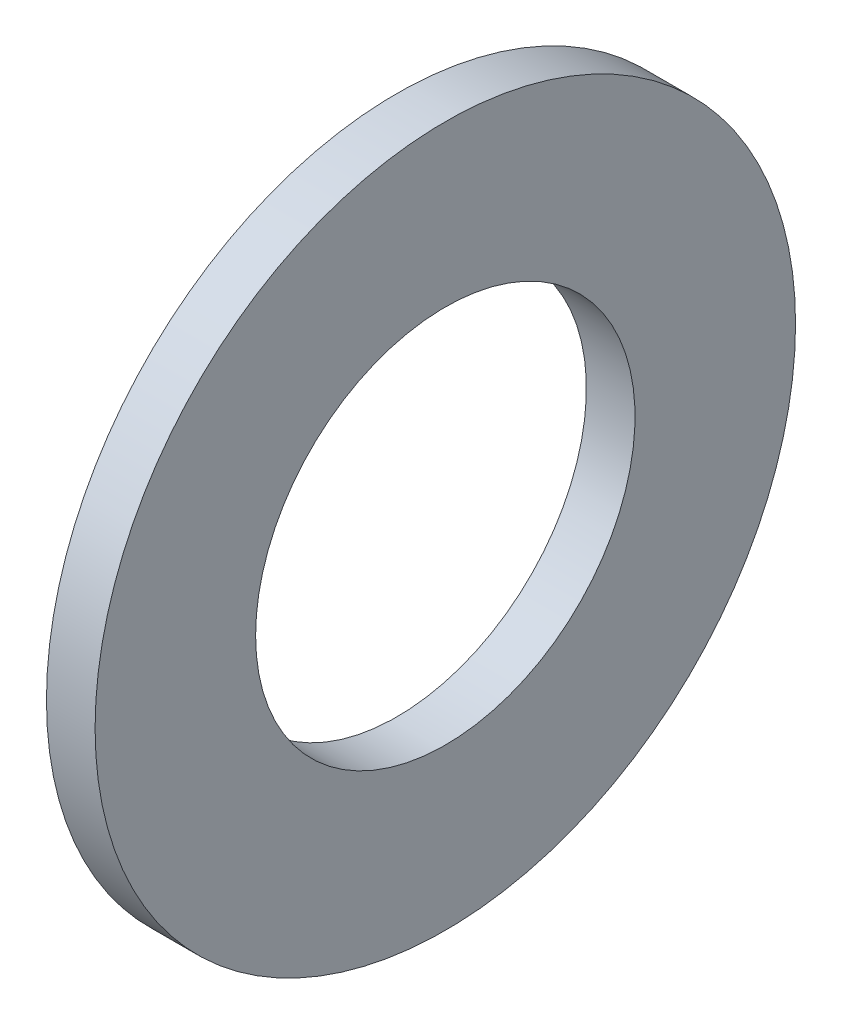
ISO-10303-21;
HEADER;
FILE_DESCRIPTION(('STEP AP214'),'2;1');
FILE_NAME('part.step','',(''),(''),'','','');
FILE_SCHEMA(('AUTOMOTIVE_DESIGN { 1 0 10303 214 1 1 1 1 }'));
ENDSEC;
DATA;
#1=APPLICATION_CONTEXT('core data for automotive mechanical design processes');
#2=APPLICATION_PROTOCOL_DEFINITION('international standard','automotive_design',2000,#1);
#3=PRODUCT_CONTEXT('',#1,'mechanical');
#4=PRODUCT('Part','Part','',(#3));
#5=PRODUCT_RELATED_PRODUCT_CATEGORY('part','',(#4));
#6=PRODUCT_DEFINITION_FORMATION('','',#4);
#7=PRODUCT_DEFINITION_CONTEXT('part definition',#1,'design');
#8=PRODUCT_DEFINITION('design','',#6,#7);
#9=PRODUCT_DEFINITION_SHAPE('','',#8);
#10=(LENGTH_UNIT() NAMED_UNIT(*) SI_UNIT(.MILLI.,.METRE.));
#11=(NAMED_UNIT(*) PLANE_ANGLE_UNIT() SI_UNIT($,.RADIAN.));
#12=(NAMED_UNIT(*) SI_UNIT($,.STERADIAN.) SOLID_ANGLE_UNIT());
#13=UNCERTAINTY_MEASURE_WITH_UNIT(LENGTH_MEASURE(1.E-05),#10,'distance_accuracy_value','');
#14=(GEOMETRIC_REPRESENTATION_CONTEXT(3) GLOBAL_UNCERTAINTY_ASSIGNED_CONTEXT((#13)) GLOBAL_UNIT_ASSIGNED_CONTEXT((#10,
#11,#12)) REPRESENTATION_CONTEXT('',''));
#15=CARTESIAN_POINT('',(0.,0.,0.));
#16=DIRECTION('',(0.,0.,1.));
#17=DIRECTION('',(1.,0.,0.));
#18=AXIS2_PLACEMENT_3D('',#15,#16,#17);
#19=CARTESIAN_POINT('',(-34.9249999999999,0.,0.));
#20=DIRECTION('',(-1.,0.,0.));
#21=DIRECTION('',(0.,0.,1.));
#22=AXIS2_PLACEMENT_3D('',#19,#20,#21);
#23=CYLINDRICAL_SURFACE('',#22,19.5);
#24=CARTESIAN_POINT('',(0.,0.,0.));
#25=DIRECTION('',(-1.,0.,0.));
#26=DIRECTION('',(0.,0.,1.));
#27=AXIS2_PLACEMENT_3D('',#24,#25,#26);
#28=CIRCLE('',#27,19.5);
#29=CARTESIAN_POINT('',(0.,0.,19.5));
#30=VERTEX_POINT('',#29);
#31=EDGE_CURVE('E10',#30,#30,#28,.T.);
#32=ORIENTED_EDGE('',*,*,#31,.F.);
#33=EDGE_LOOP('',(#32));
#34=FACE_BOUND('',#33,.T.);
#35=CARTESIAN_POINT('',(-5.,0.,0.));
#36=DIRECTION('',(-1.,0.,0.));
#37=DIRECTION('',(0.,0.,1.));
#38=AXIS2_PLACEMENT_3D('',#35,#36,#37);
#39=CIRCLE('',#38,19.5);
#40=CARTESIAN_POINT('',(-5.,0.,19.5));
#41=VERTEX_POINT('',#40);
#42=EDGE_CURVE('E45',#41,#41,#39,.T.);
#43=ORIENTED_EDGE('',*,*,#42,.T.);
#44=EDGE_LOOP('',(#43));
#45=FACE_BOUND('',#44,.T.);
#46=ADVANCED_FACE('F31',(#34,#45),#23,.F.);
#47=CARTESIAN_POINT('',(0.,19.5,0.));
#48=DIRECTION('',(-1.,0.,0.));
#49=DIRECTION('',(0.,0.,1.));
#50=AXIS2_PLACEMENT_3D('',#47,#48,#49);
#51=PLANE('',#50);
#52=CARTESIAN_POINT('',(0.,0.,0.));
#53=DIRECTION('',(-1.,0.,0.));
#54=DIRECTION('',(0.,0.,1.));
#55=AXIS2_PLACEMENT_3D('',#52,#53,#54);
#56=CIRCLE('',#55,36.);
#57=CARTESIAN_POINT('',(0.,0.,36.));
#58=VERTEX_POINT('',#57);
#59=EDGE_CURVE('E37',#58,#58,#56,.T.);
#60=ORIENTED_EDGE('',*,*,#59,.F.);
#61=EDGE_LOOP('',(#60));
#62=FACE_BOUND('',#61,.T.);
#63=ORIENTED_EDGE('',*,*,#31,.T.);
#64=EDGE_LOOP('',(#63));
#65=FACE_BOUND('',#64,.T.);
#66=ADVANCED_FACE('F60',(#62,#65),#51,.F.);
#67=CARTESIAN_POINT('',(-34.9249999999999,0.,0.));
#68=DIRECTION('',(-1.,0.,0.));
#69=DIRECTION('',(0.,0.,1.));
#70=AXIS2_PLACEMENT_3D('',#67,#68,#69);
#71=CYLINDRICAL_SURFACE('',#70,36.);
#72=CARTESIAN_POINT('',(-5.,0.,0.));
#73=DIRECTION('',(-1.,0.,0.));
#74=DIRECTION('',(0.,0.,1.));
#75=AXIS2_PLACEMENT_3D('',#72,#73,#74);
#76=CIRCLE('',#75,36.);
#77=CARTESIAN_POINT('',(-5.,0.,36.));
#78=VERTEX_POINT('',#77);
#79=EDGE_CURVE('E41',#78,#78,#76,.T.);
#80=ORIENTED_EDGE('',*,*,#79,.F.);
#81=EDGE_LOOP('',(#80));
#82=FACE_BOUND('',#81,.T.);
#83=ORIENTED_EDGE('',*,*,#59,.T.);
#84=EDGE_LOOP('',(#83));
#85=FACE_BOUND('',#84,.T.);
#86=ADVANCED_FACE('F55',(#82,#85),#71,.T.);
#87=CARTESIAN_POINT('',(-5.,36.,0.));
#88=DIRECTION('',(1.,0.,0.));
#89=DIRECTION('',(0.,0.,-1.));
#90=AXIS2_PLACEMENT_3D('',#87,#88,#89);
#91=PLANE('',#90);
#92=ORIENTED_EDGE('',*,*,#42,.F.);
#93=EDGE_LOOP('',(#92));
#94=FACE_BOUND('',#93,.T.);
#95=ORIENTED_EDGE('',*,*,#79,.T.);
#96=EDGE_LOOP('',(#95));
#97=FACE_BOUND('',#96,.T.);
#98=ADVANCED_FACE('F52',(#94,#97),#91,.F.);
#99=CLOSED_SHELL('',(#46,#66,#86,#98));
#100=MANIFOLD_SOLID_BREP('B2',#99);
#101=ADVANCED_BREP_SHAPE_REPRESENTATION('',(#18,#100),#14);
#102=SHAPE_DEFINITION_REPRESENTATION(#9,#101);
ENDSEC;
END-ISO-10303-21;
